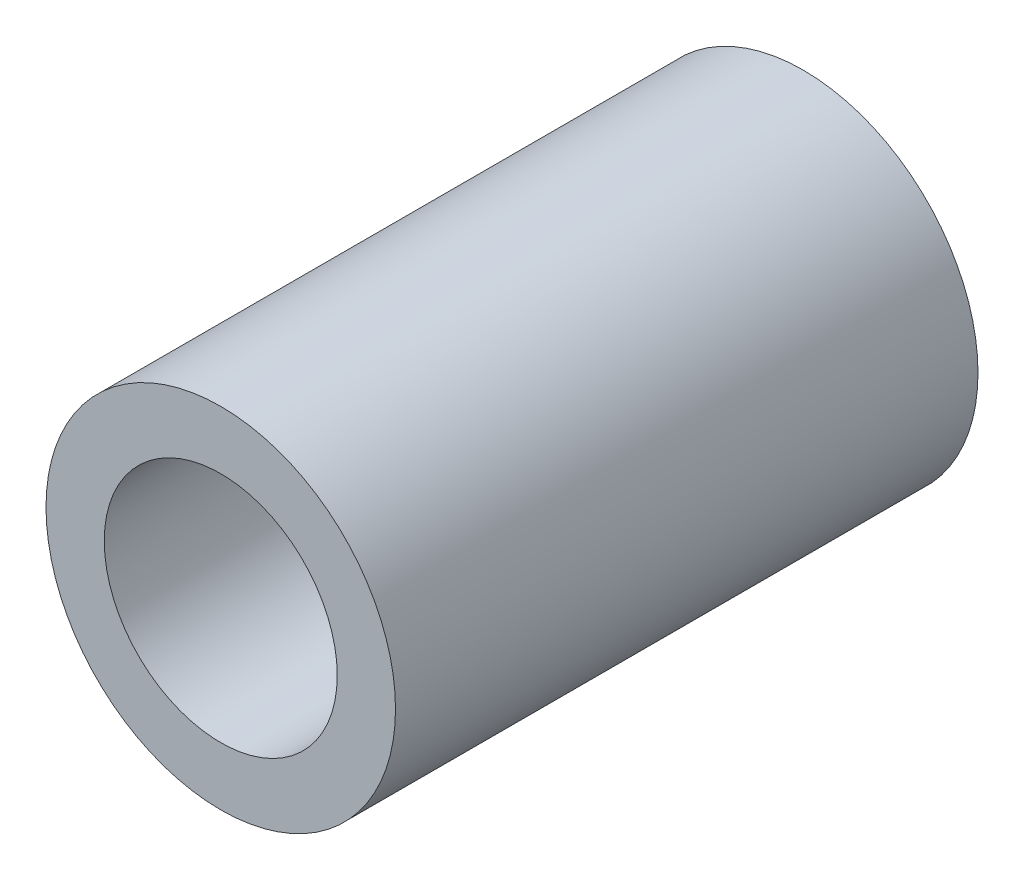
ISO-10303-21;
HEADER;
FILE_DESCRIPTION(('STEP AP214'),'2;1');
FILE_NAME('part.step','',(''),(''),'','','');
FILE_SCHEMA(('AUTOMOTIVE_DESIGN { 1 0 10303 214 1 1 1 1 }'));
ENDSEC;
DATA;
#1=APPLICATION_CONTEXT('core data for automotive mechanical design processes');
#2=APPLICATION_PROTOCOL_DEFINITION('international standard','automotive_design',2000,#1);
#3=PRODUCT_CONTEXT('',#1,'mechanical');
#4=PRODUCT('Part','Part','',(#3));
#5=PRODUCT_RELATED_PRODUCT_CATEGORY('part','',(#4));
#6=PRODUCT_DEFINITION_FORMATION('','',#4);
#7=PRODUCT_DEFINITION_CONTEXT('part definition',#1,'design');
#8=PRODUCT_DEFINITION('design','',#6,#7);
#9=PRODUCT_DEFINITION_SHAPE('','',#8);
#10=(LENGTH_UNIT() NAMED_UNIT(*) SI_UNIT(.MILLI.,.METRE.));
#11=(NAMED_UNIT(*) PLANE_ANGLE_UNIT() SI_UNIT($,.RADIAN.));
#12=(NAMED_UNIT(*) SI_UNIT($,.STERADIAN.) SOLID_ANGLE_UNIT());
#13=UNCERTAINTY_MEASURE_WITH_UNIT(LENGTH_MEASURE(1.E-05),#10,'distance_accuracy_value','');
#14=(GEOMETRIC_REPRESENTATION_CONTEXT(3) GLOBAL_UNCERTAINTY_ASSIGNED_CONTEXT((#13)) GLOBAL_UNIT_ASSIGNED_CONTEXT((#10,
#11,#12)) REPRESENTATION_CONTEXT('',''));
#15=CARTESIAN_POINT('',(0.,0.,0.));
#16=DIRECTION('',(0.,0.,1.));
#17=DIRECTION('',(1.,0.,0.));
#18=AXIS2_PLACEMENT_3D('',#15,#16,#17);
#19=CARTESIAN_POINT('',(0.,0.,100.));
#20=DIRECTION('',(0.,0.,1.));
#21=DIRECTION('',(1.,0.,0.));
#22=AXIS2_PLACEMENT_3D('',#19,#20,#21);
#23=PLANE('',#22);
#24=CARTESIAN_POINT('',(0.,0.,100.));
#25=DIRECTION('',(0.,0.,1.));
#26=DIRECTION('',(1.,0.,0.));
#27=AXIS2_PLACEMENT_3D('',#24,#25,#26);
#28=CIRCLE('',#27,30.);
#29=CARTESIAN_POINT('',(30.,0.,100.));
#30=VERTEX_POINT('',#29);
#31=EDGE_CURVE('E12',#30,#30,#28,.T.);
#32=ORIENTED_EDGE('',*,*,#31,.T.);
#33=EDGE_LOOP('',(#32));
#34=FACE_BOUND('',#33,.T.);
#35=CARTESIAN_POINT('',(0.,0.,100.));
#36=DIRECTION('',(0.,0.,1.));
#37=DIRECTION('',(1.,0.,0.));
#38=AXIS2_PLACEMENT_3D('',#35,#36,#37);
#39=CIRCLE('',#38,20.);
#40=CARTESIAN_POINT('',(20.,0.,100.));
#41=VERTEX_POINT('',#40);
#42=EDGE_CURVE('E54',#41,#41,#39,.T.);
#43=ORIENTED_EDGE('',*,*,#42,.F.);
#44=EDGE_LOOP('',(#43));
#45=FACE_BOUND('',#44,.T.);
#46=ADVANCED_FACE('F43',(#34,#45),#23,.T.);
#47=CARTESIAN_POINT('',(0.,0.,0.));
#48=DIRECTION('',(0.,0.,1.));
#49=DIRECTION('',(1.,0.,0.));
#50=AXIS2_PLACEMENT_3D('',#47,#48,#49);
#51=PLANE('',#50);
#52=CARTESIAN_POINT('',(0.,0.,0.));
#53=DIRECTION('',(0.,0.,1.));
#54=DIRECTION('',(1.,0.,0.));
#55=AXIS2_PLACEMENT_3D('',#52,#53,#54);
#56=CIRCLE('',#55,30.);
#57=CARTESIAN_POINT('',(30.,0.,0.));
#58=VERTEX_POINT('',#57);
#59=EDGE_CURVE('E50',#58,#58,#56,.T.);
#60=ORIENTED_EDGE('',*,*,#59,.F.);
#61=EDGE_LOOP('',(#60));
#62=FACE_BOUND('',#61,.T.);
#63=CARTESIAN_POINT('',(0.,0.,0.));
#64=DIRECTION('',(0.,0.,1.));
#65=DIRECTION('',(1.,0.,0.));
#66=AXIS2_PLACEMENT_3D('',#63,#64,#65);
#67=CIRCLE('',#66,20.);
#68=CARTESIAN_POINT('',(20.,0.,0.));
#69=VERTEX_POINT('',#68);
#70=EDGE_CURVE('E58',#69,#69,#67,.T.);
#71=ORIENTED_EDGE('',*,*,#70,.T.);
#72=EDGE_LOOP('',(#71));
#73=FACE_BOUND('',#72,.T.);
#74=ADVANCED_FACE('F64',(#62,#73),#51,.F.);
#75=CARTESIAN_POINT('',(0.,0.,100.));
#76=DIRECTION('',(0.,0.,-1.));
#77=DIRECTION('',(-1.,0.,0.));
#78=AXIS2_PLACEMENT_3D('',#75,#76,#77);
#79=CYLINDRICAL_SURFACE('',#78,30.);
#80=ORIENTED_EDGE('',*,*,#31,.F.);
#81=EDGE_LOOP('',(#80));
#82=FACE_BOUND('',#81,.T.);
#83=ORIENTED_EDGE('',*,*,#59,.T.);
#84=EDGE_LOOP('',(#83));
#85=FACE_BOUND('',#84,.T.);
#86=ADVANCED_FACE('F45',(#82,#85),#79,.T.);
#87=CARTESIAN_POINT('',(0.,0.,100.));
#88=DIRECTION('',(0.,0.,-1.));
#89=DIRECTION('',(-1.,0.,0.));
#90=AXIS2_PLACEMENT_3D('',#87,#88,#89);
#91=CYLINDRICAL_SURFACE('',#90,20.);
#92=ORIENTED_EDGE('',*,*,#42,.T.);
#93=EDGE_LOOP('',(#92));
#94=FACE_BOUND('',#93,.T.);
#95=ORIENTED_EDGE('',*,*,#70,.F.);
#96=EDGE_LOOP('',(#95));
#97=FACE_BOUND('',#96,.T.);
#98=ADVANCED_FACE('F66',(#94,#97),#91,.F.);
#99=CLOSED_SHELL('',(#46,#74,#86,#98));
#100=MANIFOLD_SOLID_BREP('B2',#99);
#101=ADVANCED_BREP_SHAPE_REPRESENTATION('',(#18,#100),#14);
#102=SHAPE_DEFINITION_REPRESENTATION(#9,#101);
ENDSEC;
END-ISO-10303-21;
